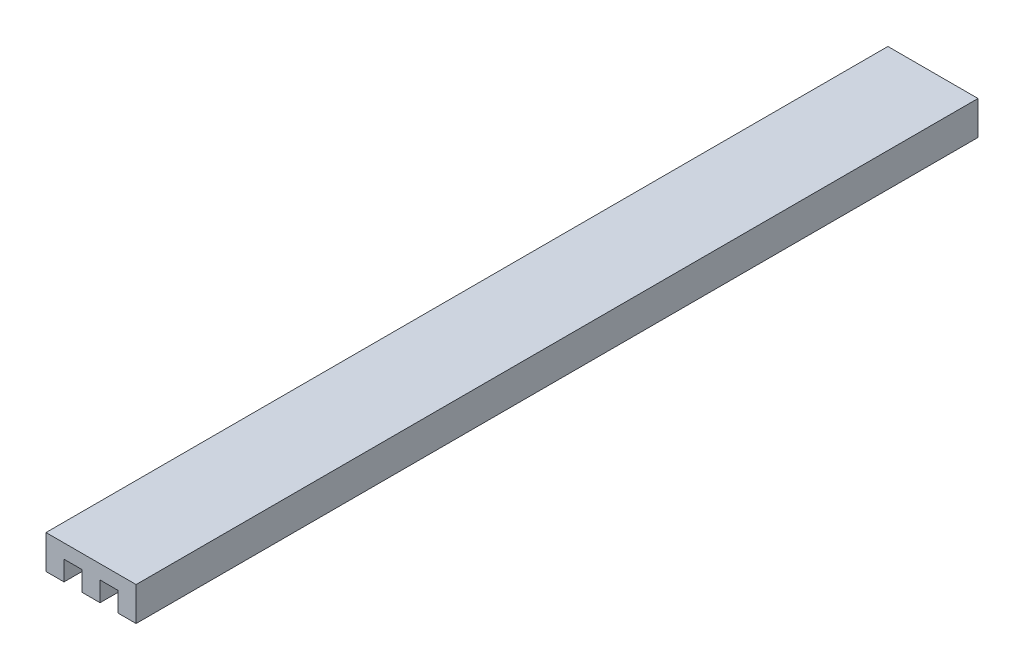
from build123d import *

# Parameters (mm, degrees)
BOSS_EXTRU_1_DEPTH = 149.5


with BuildPart() as part:
    # Esquisse1 → Boss.-Extru.1 (new body)
    with BuildSketch(Plane.XY):
        Polygon((16, 0), (16, -6), (12.8, -6), (12.8, -2.5), (9.6, -2.5), (9.6, -6), (6.4, -6), (6.4, -2.5), (3.2, -2.5), (3.2, -6), (0, -6), (0, 0), align=None)
    extrude(amount=BOSS_EXTRU_1_DEPTH)


solid = part.part
